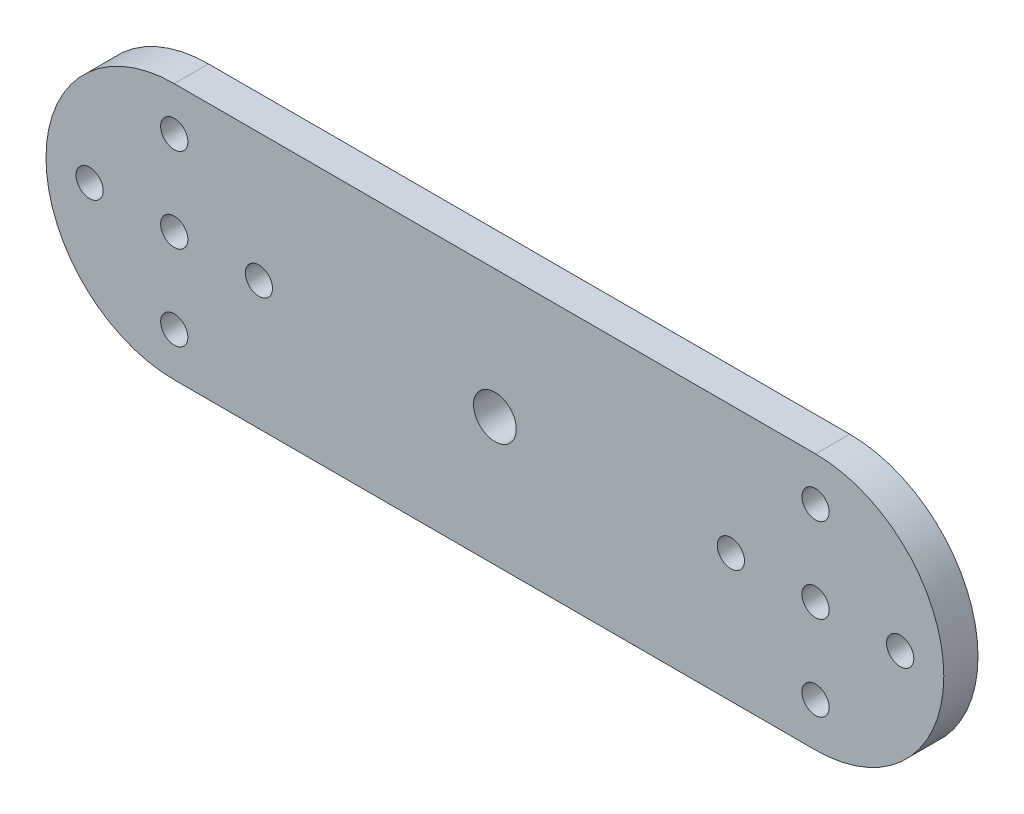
from build123d import *

# Parameters (mm, degrees)
SKETCH1_R           = 1.59
SKETCH1_R_2         = 2.5
BOSS_EXTRUDE1_DEPTH = 4


with BuildPart() as part:
    # Sketch1 → Boss-Extrude1 (new body)
    with BuildSketch(Plane.XY):
        with BuildLine():
            Line((-37.5, 15), (37.5, 15))
            ThreePointArc((37.5, 15), (52.5, 0), (37.5, -15))
            Line((37.5, -15), (-37.5, -15))
            ThreePointArc((-37.5, -15), (-52.5, 0), (-37.5, 15))
        make_face()
        with Locations((-37.5, 0)):
            Circle(SKETCH1_R, mode=Mode.SUBTRACT)
        with Locations((37.5, 0)):
            Circle(SKETCH1_R, mode=Mode.SUBTRACT)
        with Locations((-47.4, 0)):
            Circle(SKETCH1_R, mode=Mode.SUBTRACT)
        with Locations((-37.5, 9.9)):
            Circle(SKETCH1_R, mode=Mode.SUBTRACT)
        with Locations((-27.6, 0)):
            Circle(SKETCH1_R, mode=Mode.SUBTRACT)
        with Locations((-37.5, -9.9)):
            Circle(SKETCH1_R, mode=Mode.SUBTRACT)
        with Locations((37.5, -9.9)):
            Circle(SKETCH1_R, mode=Mode.SUBTRACT)
        with Locations((27.6, 0)):
            Circle(SKETCH1_R, mode=Mode.SUBTRACT)
        with Locations((37.5, 9.9)):
            Circle(SKETCH1_R, mode=Mode.SUBTRACT)
        with Locations((47.4, 0)):
            Circle(SKETCH1_R, mode=Mode.SUBTRACT)
        Circle(SKETCH1_R_2, mode=Mode.SUBTRACT)
    extrude(amount=BOSS_EXTRUDE1_DEPTH)


solid = part.part
